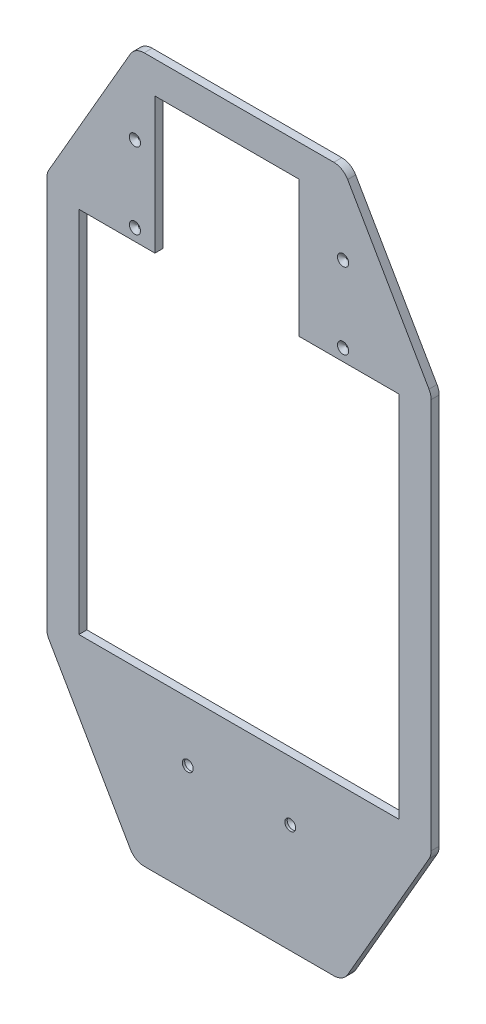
from build123d import *

# Parameters (mm, degrees)
EXTRUDE_1_DEPTH        = 30
EXTRUDE_2_DEPTH        = 40
MIRROR_2_COPY_1_DEPTH  = 40
EXTRUDE_START          = 20
SKETCH_3_W             = 200
SKETCH_3_H             = 230
EXTRUDE_3_DEPTH        = 20
EXTRUDE_START_2        = -10
EXTRUDE_11_DEPTH       = 15
FILLET_3_R             = 5
SKETCH_6_W             = 22
SKETCH_6_H             = 22
EXTRUDE_12_DEPTH       = 225
M8X1_0_1_AT_2_COUNT    = 2
M8X1_0_1_AT_2_PITCH    = 47.5
SKETCH_14_W            = 75
SKETCH_14_H            = 1
CUT_EXTRUDE_1_DEPTH    = 10
EXTRUDE_START_3        = -21
EXTRUDE_13_DEPTH       = 20
CUT_EXTRUDE_3_DEPTH    = 20
FILLET_4_R             = 5
EXTRUDE_14_REACH       = 388.297
EXTRUDE_START_4        = 5
SKETCH_20_W            = 200
SKETCH_20_H            = 230
EXTRUDE_15_DEPTH       = 5
SKETCH_24_W            = 75
SKETCH_24_H            = 85
EXTRUDE_16_DEPTH       = 30
HOLE_WIZARD_M8_1_D     = 6.8
HOLE_WIZARD_M8_1_DEPTH = 20
HOLE_WIZARD_M8_1_TIP   = 2.042926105
EXTRUDE_START_5        = -12
EXTRUDE_17_DEPTH       = 5
PATTERN_LINEAR_2_COUNT = 2
PATTERN_LINEAR_2_PITCH = 26
HOLE_WIZARD_M8_2_D     = 6.8
HOLE_WIZARD_M8_2_DEPTH = 22.5
HOLE_WIZARD_M8_2_TIP   = 2.042926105
SKETCH_32_W            = 15
SKETCH_32_H            = 85
CUT_EXTRUDE_7_DEPTH    = 30
SKETCH_33_W            = 90
SKETCH_33_H            = 85
CUT_EXTRUDE_8_DEPTH    = 12
SKETCH_34_W            = 100
SKETCH_34_H            = 59
CUT_EXTRUDE_9_DEPTH    = 9.25
SKETCH_35_W            = 350.252733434
SKETCH_35_H            = 581.551708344
CUT_EXTRUDE_10_DEPTH   = 21
CUT_EXTRUDE_START      = -5
SKETCH_53_W            = 746.993473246
SKETCH_53_H            = 735.961924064
CUT_EXTRUDE_26_DEPTH   = 110
SKETCH_54_OUTSIDE_W    = 605.222
SKETCH_54_OUTSIDE_H    = 775.222
CUT_EXTRUDE_27_DEPTH   = 110


with BuildPart() as part:
    # Sketch 1 → Extrude 1 (new body)
    with BuildSketch(Plane.XY):
        with BuildLine():
            Line((-118.660254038, 127.025650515), (-67.868239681, 215))
            ThreePointArc((-67.868239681, 215), (-64.207985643, 218.660254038), (-59.207985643, 220))
            Line((-59.207985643, 220), (59.207985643, 220))
            ThreePointArc((59.207985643, 220), (64.207985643, 218.660254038), (67.868239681, 215))
            Line((67.868239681, 215), (118.660254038, 127.025650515))
            ThreePointArc((118.660254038, 127.025650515), (119.659258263, 124.613840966), (120, 122.025650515))
            Line((120, 122.025650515), (120, -122.025650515))
            ThreePointArc((120, -122.025650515), (119.659258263, -124.613840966), (118.660254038, -127.025650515))
            Line((118.660254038, -127.025650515), (67.868239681, -215))
            ThreePointArc((67.868239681, -215), (64.207985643, -218.660254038), (59.207985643, -220))
            Line((59.207985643, -220), (-59.207985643, -220))
            ThreePointArc((-59.207985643, -220), (-64.207985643, -218.660254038), (-67.868239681, -215))
            Line((-67.868239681, -215), (-118.660254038, -127.025650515))
            ThreePointArc((-118.660254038, -127.025650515), (-119.659258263, -124.613840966), (-120, -122.025650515))
            Line((-120, -122.025650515), (-120, 122.025650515))
            ThreePointArc((-120, 122.025650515), (-119.659258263, 124.613840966), (-118.660254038, 127.025650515))
        make_face()
        with BuildLine():
            Line((-98.660254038, 121.666666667), (-56.321234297, 195))
            ThreePointArc((-56.321234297, 195), (-52.660980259, 198.660254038), (-47.660980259, 200))
            Line((-47.660980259, 200), (47.660980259, 200))
            ThreePointArc((47.660980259, 200), (52.660980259, 198.660254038), (56.321234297, 195))
            Line((56.321234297, 195), (98.660254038, 121.666666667))
            ThreePointArc((98.660254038, 121.666666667), (99.659258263, 119.254857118), (100, 116.666666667))
            Line((100, 116.666666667), (100, -116.666666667))
            ThreePointArc((100, -116.666666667), (99.659258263, -119.254857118), (98.660254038, -121.666666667))
            Line((98.660254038, -121.666666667), (56.321234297, -195))
            ThreePointArc((56.321234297, -195), (52.660980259, -198.660254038), (47.660980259, -200))
            Line((47.660980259, -200), (-47.660980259, -200))
            ThreePointArc((-47.660980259, -200), (-52.660980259, -198.660254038), (-56.321234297, -195))
            Line((-56.321234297, -195), (-98.660254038, -121.666666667))
            ThreePointArc((-98.660254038, -121.666666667), (-99.659258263, -119.254857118), (-100, -116.666666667))
            Line((-100, -116.666666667), (-100, 116.666666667))
            ThreePointArc((-100, 116.666666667), (-99.659258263, 119.254857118), (-98.660254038, 121.666666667))
        make_face(mode=Mode.SUBTRACT)
    extrude(amount=EXTRUDE_1_DEPTH)

    # Sketch 2 → Extrude 2 (add)
    with BuildSketch(Plane.XY.offset(30)):
        Polygon((-100, 130), (-70, 130), (-70, 200), (-37.5, 200), (-37.5, 115), (-100, 115), align=None)
    extrude_2 = extrude(amount=-EXTRUDE_2_DEPTH)

    # Mirror 1: Extrude 2 across plane
    add(extrude_2.mirror(Plane.ZX))

    # Mirror 2: Extrude 2 across plane
    add(extrude_2.mirror(Plane(origin=(0, 0, 0), x_dir=(0, 0, 1), z_dir=(1, 0, 0))))

    # Mirror 2 copy 1 sketch → Mirror 2 copy 1 (add)
    with BuildSketch(Plane(origin=(0, 0, 30), x_dir=(-1, 0, 0), z_dir=(0, 0, 1))):
        Polygon((-100, 130), (-70, 130), (-70, 200), (-37.5, 200), (-37.5, 115), (-100, 115), align=None)
    extrude(amount=-MIRROR_2_COPY_1_DEPTH)

    # Sketch 3 → Extrude 3 (add)
    with BuildSketch(Plane(origin=(0, 0, 0), x_dir=(-1, 0, 0), z_dir=(0, 0, -1)).offset(EXTRUDE_START)):
        with BuildLine():
            Line((120, -122.025650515), (120, 122.025650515))
            ThreePointArc((120, 122.025650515), (119.659258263, 124.613840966), (118.660254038, 127.025650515))
            Line((118.660254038, 127.025650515), (67.868239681, 215))
            ThreePointArc((67.868239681, 215), (64.207985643, 218.660254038), (59.207985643, 220))
            Line((59.207985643, 220), (-59.207985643, 220))
            ThreePointArc((-59.207985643, 220), (-64.207985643, 218.660254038), (-67.868239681, 215))
            Line((-67.868239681, 215), (-118.660254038, 127.025650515))
            ThreePointArc((-118.660254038, 127.025650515), (-119.659258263, 124.613840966), (-120, 122.025650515))
            Line((-120, 122.025650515), (-120, -122.025650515))
            ThreePointArc((-120, -122.025650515), (-119.659258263, -124.613840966), (-118.660254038, -127.025650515))
            Line((-118.660254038, -127.025650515), (-67.868239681, -215))
            ThreePointArc((-67.868239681, -215), (-64.207985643, -218.660254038), (-59.207985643, -220))
            Line((-59.207985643, -220), (59.207985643, -220))
            ThreePointArc((59.207985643, -220), (64.207985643, -218.660254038), (67.868239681, -215))
            Line((67.868239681, -215), (118.660254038, -127.025650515))
            ThreePointArc((118.660254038, -127.025650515), (119.659258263, -124.613840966), (120, -122.025650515))
        make_face()
        Rectangle(SKETCH_3_W, SKETCH_3_H, mode=Mode.SUBTRACT)
    extrude(amount=-EXTRUDE_3_DEPTH)

    # Sketch 5 → Extrude 11 (add)
    with BuildSketch(Plane(origin=(0, 0, -20), x_dir=(-1, 0, 0), z_dir=(0, 0, -1)).offset(EXTRUDE_START_2)):
        with BuildLine():
            Line((-67.868239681, 215), (-67.868239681, 310))
            Line((-67.868239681, 310), (67.868239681, 310))
            Line((67.868239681, 310), (67.868239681, 215))
            ThreePointArc((67.868239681, 215), (64.207985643, 218.660254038), (59.207985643, 220))
            Line((59.207985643, 220), (-59.207985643, 220))
            ThreePointArc((-59.207985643, 220), (-64.207985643, 218.660254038), (-67.868239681, 215))
        make_face()
    extrude_11 = extrude(amount=-EXTRUDE_11_DEPTH)

    # Fillet 3
    fillet_3_edges = [part.edges().sort_by_distance(p)[0] for p in [
        (67.868239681, 310, -2.5),
        (-67.868239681, 310, -2.5),
    ]]
    fillet(fillet_3_edges, radius=FILLET_3_R)

    # Sketch 6 → Extrude 12 (add, symmetric)
    with BuildSketch(Plane(origin=(0, 0, 0), x_dir=(0, 0, -1), z_dir=(1, 0, 0))):
        with Locations((6, 210)):
            Rectangle(SKETCH_6_W, SKETCH_6_H)
    extrude_12 = extrude(amount=EXTRUDE_12_DEPTH, both=True)

    # Sketch 11 → M8x1.0 _1 (revolve, cut)
    with BuildSketch(Plane(origin=(-65, 122.5, 30), x_dir=(0, -1, 0), z_dir=(1, 0, 0))):
        Polygon((0, 0), (0, 23.103012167), (3.5, 21), (3.5, 0), align=None)
    m8x1_0_1 = revolve(axis=Axis((-65, 122.5, 36.35), (0, 0, -1)), mode=Mode.SUBTRACT)

    # M8x1.0 _1 at 2: M8x1.0 _1 ×2
    with Locations(*[(0, i * M8X1_0_1_AT_2_PITCH, 0) for i in range(1, M8X1_0_1_AT_2_COUNT)]):
        add(m8x1_0_1, mode=Mode.SUBTRACT)

    # Mirror 7: M8x1.0 _1 across plane
    add(m8x1_0_1.mirror(Plane(origin=(0, 0, 0), x_dir=(0, 0, 1), z_dir=(1, 0, 0))), mode=Mode.SUBTRACT)

    # Mirror 7 copy 1 sketch → Mirror 7 copy 1 (revolve, cut)
    with BuildSketch(Plane(origin=(65, 170, 30), x_dir=(0, -1, 0), z_dir=(-1, 0, 0))):
        Polygon((0, 0), (0, -23.103012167), (3.5, -21), (3.5, 0), align=None)
    revolve(axis=Axis((65, 170, 36.35), (0, 0, 1)), mode=Mode.SUBTRACT)

    # Sketch 14 → Cut-Extrude 1 (cut)
    with BuildSketch(Plane.XY):
        with Locations((0, 199.5)):
            Rectangle(SKETCH_14_W, SKETCH_14_H)
    cut_extrude_1 = extrude(amount=CUT_EXTRUDE_1_DEPTH, mode=Mode.SUBTRACT)

    # Mirror 8: Extrude 11, Extrude 12, Cut-Extrude 1 across plane
    add(extrude_11.mirror(Plane.ZX))
    add(extrude_12.mirror(Plane.ZX))
    add(cut_extrude_1.mirror(Plane.ZX), mode=Mode.SUBTRACT)

    # Sketch 16 → Extrude 13 (add)
    with BuildSketch(Plane.XY.offset(5).offset(EXTRUDE_START_3)):
        with BuildLine():
            Line((135, 199), (135, -199))
            Line((135, -199), (77.105843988, -199))
            Line((77.105843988, -199), (118.660254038, -127.025650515))
            ThreePointArc((118.660254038, -127.025650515), (119.659258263, -124.613840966), (120, -122.025650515))
            Line((120, -122.025650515), (120, 122.025650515))
            ThreePointArc((120, 122.025650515), (119.659258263, 124.613840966), (118.660254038, 127.025650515))
            Line((118.660254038, 127.025650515), (77.105843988, 199))
            Line((77.105843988, 199), (135, 199))
        make_face()
        with BuildLine():
            Line((-135, 199), (-77.105843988, 199))
            Line((-77.105843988, 199), (-118.660254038, 127.025650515))
            ThreePointArc((-118.660254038, 127.025650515), (-119.659258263, 124.613840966), (-120, 122.025650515))
            Line((-120, 122.025650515), (-120, -122.025650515))
            ThreePointArc((-120, -122.025650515), (-119.659258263, -124.613840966), (-118.660254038, -127.025650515))
            Line((-118.660254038, -127.025650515), (-77.105843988, -199))
            Line((-77.105843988, -199), (-135, -199))
            Line((-135, -199), (-135, 199))
        make_face()
    extrude(amount=EXTRUDE_13_DEPTH)

    # Sketch 17 → Cut-Extrude 3 (cut)
    with BuildSketch(Plane.XY.offset(4)):
        Polygon((105.973357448, 199), (135, 148.724380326), (135, 199), align=None)
        Polygon((135, -199), (105.973357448, -199), (135, -148.724380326), align=None)
        Polygon((-105.973357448, -199), (-135, -148.724380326), (-135, -199), align=None)
        Polygon((-135, 199), (-105.973357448, 199), (-135, 148.724380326), align=None)
    extrude(amount=-CUT_EXTRUDE_3_DEPTH, mode=Mode.SUBTRACT)

    # Fillet 4
    fillet_4_edges = [part.edges().sort_by_distance(p)[0] for p in [
        (-135, 148.724380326, -6),
        (-105.973357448, 199, -6),
        (-105.973357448, -199, -6),
        (-135, -148.724380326, -6),
        (135, -148.724380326, -6),
        (105.973357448, -199, -6),
        (105.973357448, 199, -6),
        (135, 148.724380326, -6),
    ]]
    fillet(fillet_4_edges, radius=FILLET_4_R)

    # Sketch 19 → Extrude 14 (add, up to next)
    with BuildSketch(Plane.XY.offset(30), mode=Mode.PRIVATE) as extrude_14_sk1:
        Polygon((-93.849001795, 130), (-70, 130), (-70, 171.307682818), align=None)
    extrude_14_tool1 = extrude(extrude_14_sk1.sketch, amount=-EXTRUDE_14_REACH, mode=Mode.PRIVATE) - part.part
    # Sketch 19 → Extrude 14 (add, up to next)
    with BuildSketch(Plane.XY.offset(30), mode=Mode.PRIVATE) as extrude_14_sk2:
        Polygon((93.849001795, 130), (70, 171.307682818), (70, 130), align=None)
    extrude_14_tool2 = extrude(extrude_14_sk2.sketch, amount=-EXTRUDE_14_REACH, mode=Mode.PRIVATE) - part.part
    # Sketch 19 → Extrude 14 (add, up to next)
    with BuildSketch(Plane.XY.offset(30), mode=Mode.PRIVATE) as extrude_14_sk3:
        Polygon((93.849001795, -130), (70, -130), (70, -171.307682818), align=None)
    extrude_14_tool3 = extrude(extrude_14_sk3.sketch, amount=-EXTRUDE_14_REACH, mode=Mode.PRIVATE) - part.part
    # Sketch 19 → Extrude 14 (add, up to next)
    with BuildSketch(Plane.XY.offset(30), mode=Mode.PRIVATE) as extrude_14_sk4:
        Polygon((-93.849001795, -130), (-70, -171.307682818), (-70, -130), align=None)
    extrude_14_tool4 = extrude(extrude_14_sk4.sketch, amount=-EXTRUDE_14_REACH, mode=Mode.PRIVATE) - part.part
    add(extrude_14_tool1.solids().sort_by_distance((-77.949667, 143.769228, 30))[0])
    add(extrude_14_tool2.solids().sort_by_distance((77.949667, 143.769228, 30))[0])
    add(extrude_14_tool3.solids().sort_by_distance((77.949667, -143.769228, 30))[0])
    add(extrude_14_tool4.solids().sort_by_distance((-77.949667, -143.769228, 30))[0])

    # Sketch 20 → Extrude 15 (add)
    with BuildSketch(Plane(origin=(0, 0, -20), x_dir=(-1, 0, 0), z_dir=(0, 0, -1)).offset(EXTRUDE_START_4)):
        with BuildLine():
            Line((120, -122.025650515), (120, 122.025650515))
            ThreePointArc((120, 122.025650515), (119.659258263, 124.613840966), (118.660254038, 127.025650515))
            Line((118.660254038, 127.025650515), (67.868239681, 215))
            ThreePointArc((67.868239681, 215), (64.207985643, 218.660254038), (59.207985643, 220))
            Line((59.207985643, 220), (-59.207985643, 220))
            ThreePointArc((-59.207985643, 220), (-64.207985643, 218.660254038), (-67.868239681, 215))
            Line((-67.868239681, 215), (-118.660254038, 127.025650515))
            ThreePointArc((-118.660254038, 127.025650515), (-119.659258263, 124.613840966), (-120, 122.025650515))
            Line((-120, 122.025650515), (-120, -122.025650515))
            ThreePointArc((-120, -122.025650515), (-119.659258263, -124.613840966), (-118.660254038, -127.025650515))
            Line((-118.660254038, -127.025650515), (-67.868239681, -215))
            ThreePointArc((-67.868239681, -215), (-64.207985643, -218.660254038), (-59.207985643, -220))
            Line((-59.207985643, -220), (59.207985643, -220))
            ThreePointArc((59.207985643, -220), (64.207985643, -218.660254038), (67.868239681, -215))
            Line((67.868239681, -215), (118.660254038, -127.025650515))
            ThreePointArc((118.660254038, -127.025650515), (119.659258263, -124.613840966), (120, -122.025650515))
        make_face()
        Rectangle(SKETCH_20_W, SKETCH_20_H, mode=Mode.SUBTRACT)
    extrude(amount=-EXTRUDE_15_DEPTH)

    # Sketch 24 → Extrude 16 (add)
    with BuildSketch(Plane.XY):
        with Locations((0, -157.5)):
            Rectangle(SKETCH_24_W, SKETCH_24_H)
    extrude(amount=EXTRUDE_16_DEPTH)

    # Hole Wizard M8 _1
    with Locations(Plane(origin=(0, -115, -22), x_dir=(0, 0, 1), z_dir=(0, 1, 0))):
        with Locations((0, 0)):
            Hole(HOLE_WIZARD_M8_1_D / 2, depth=HOLE_WIZARD_M8_1_DEPTH)
            with Locations((0, 0, -(HOLE_WIZARD_M8_1_DEPTH + HOLE_WIZARD_M8_1_TIP / 2))):  # 118° drill point
                Cone(0, HOLE_WIZARD_M8_1_D / 2, HOLE_WIZARD_M8_1_TIP, mode=Mode.SUBTRACT)

    # Sketch 27 → Extrude 17 (add)
    with BuildSketch(Plane.XY.offset(30).offset(EXTRUDE_START_5)):
        Polygon((-16, -115), (-16, -105), (16, -105), (16, -115), (12, -115), (12, -111), (-12, -111), (-12, -115), align=None)
    extrude_17 = extrude(amount=-EXTRUDE_17_DEPTH)

    # Pattern Linear 2: Extrude 17 ×2
    with Locations(*[(0, 0, -i * PATTERN_LINEAR_2_PITCH) for i in range(1, PATTERN_LINEAR_2_COUNT)]):
        add(extrude_17)

    # Hole Wizard M8 _2
    with Locations(Plane(origin=(-32, -152, 30), x_dir=(1, 0, 0), z_dir=(0, 0, 1))):
        with Locations((0, 0), (64, 0)):
            Hole(HOLE_WIZARD_M8_2_D / 2, depth=HOLE_WIZARD_M8_2_DEPTH)
            with Locations((0, 0, -(HOLE_WIZARD_M8_2_DEPTH + HOLE_WIZARD_M8_2_TIP / 2))):  # 118° drill point
                Cone(0, HOLE_WIZARD_M8_2_D / 2, HOLE_WIZARD_M8_2_TIP, mode=Mode.SUBTRACT)

    # Sketch 32 → Cut-Extrude 7 (cut)
    with BuildSketch(Plane.XY.offset(30)):
        with Locations((-45, 157.5)):
            Rectangle(SKETCH_32_W, SKETCH_32_H)
    extrude(amount=-CUT_EXTRUDE_7_DEPTH, mode=Mode.SUBTRACT)

    # Sketch 33 → Cut-Extrude 8 (cut)
    with BuildSketch(Plane.XY):
        with Locations((-7.5, 157.5)):
            Rectangle(SKETCH_33_W, SKETCH_33_H)
    extrude(amount=-CUT_EXTRUDE_8_DEPTH, mode=Mode.SUBTRACT)

    # Sketch 34 → Cut-Extrude 9 (cut)
    with BuildSketch(Plane.XY.offset(30)):
        with Locations((0, -144.5)):
            Rectangle(SKETCH_34_W, SKETCH_34_H)
    extrude(amount=-CUT_EXTRUDE_9_DEPTH, mode=Mode.SUBTRACT)

    # Sketch 35 → Cut-Extrude 10 (cut)
    with BuildSketch(Plane.XY.offset(30)):
        Rectangle(SKETCH_35_W, SKETCH_35_H)
    extrude(amount=-CUT_EXTRUDE_10_DEPTH, mode=Mode.SUBTRACT)

    # Sketch 53 → Cut-Extrude 26 (cut)
    with BuildSketch(Plane.XY.offset(9).offset(CUT_EXTRUDE_START)):
        Rectangle(SKETCH_53_W, SKETCH_53_H)
    extrude(amount=-CUT_EXTRUDE_26_DEPTH, mode=Mode.SUBTRACT)

    # Sketch 54 outside → Cut-Extrude 27 (cut)
    with BuildSketch(Plane.XY.offset(9)):
        Rectangle(SKETCH_54_OUTSIDE_W, SKETCH_54_OUTSIDE_H)
        with BuildLine():
            Line((59.207985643, 220), (-59.207985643, 220))
            ThreePointArc((-59.207985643, 220), (-64.207985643, 218.660254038), (-67.868239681, 215))
            Line((-67.868239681, 215), (-118.660254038, 127.025650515))
            ThreePointArc((-118.660254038, 127.025650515), (-119.659258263, 124.613840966), (-120, 122.025650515))
            Line((-120, 122.025650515), (-120, -122.025650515))
            ThreePointArc((-120, -122.025650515), (-119.659258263, -124.613840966), (-118.660254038, -127.025650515))
            Line((-118.660254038, -127.025650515), (-67.868239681, -215))
            ThreePointArc((-67.868239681, -215), (-64.207985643, -218.660254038), (-59.207985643, -220))
            Line((-59.207985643, -220), (59.207985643, -220))
            ThreePointArc((59.207985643, -220), (64.207985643, -218.660254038), (67.868239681, -215))
            Line((67.868239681, -215), (118.660254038, -127.025650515))
            ThreePointArc((118.660254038, -127.025650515), (119.659258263, -124.613840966), (120, -122.025650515))
            Line((120, -122.025650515), (120, 122.025650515))
            ThreePointArc((120, 122.025650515), (119.659258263, 124.613840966), (118.660254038, 127.025650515))
            Line((118.660254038, 127.025650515), (67.868239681, 215))
            ThreePointArc((67.868239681, 215), (64.207985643, 218.660254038), (59.207985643, 220))
        make_face(mode=Mode.SUBTRACT)
    extrude(amount=-CUT_EXTRUDE_27_DEPTH, mode=Mode.SUBTRACT)


solid = part.part
